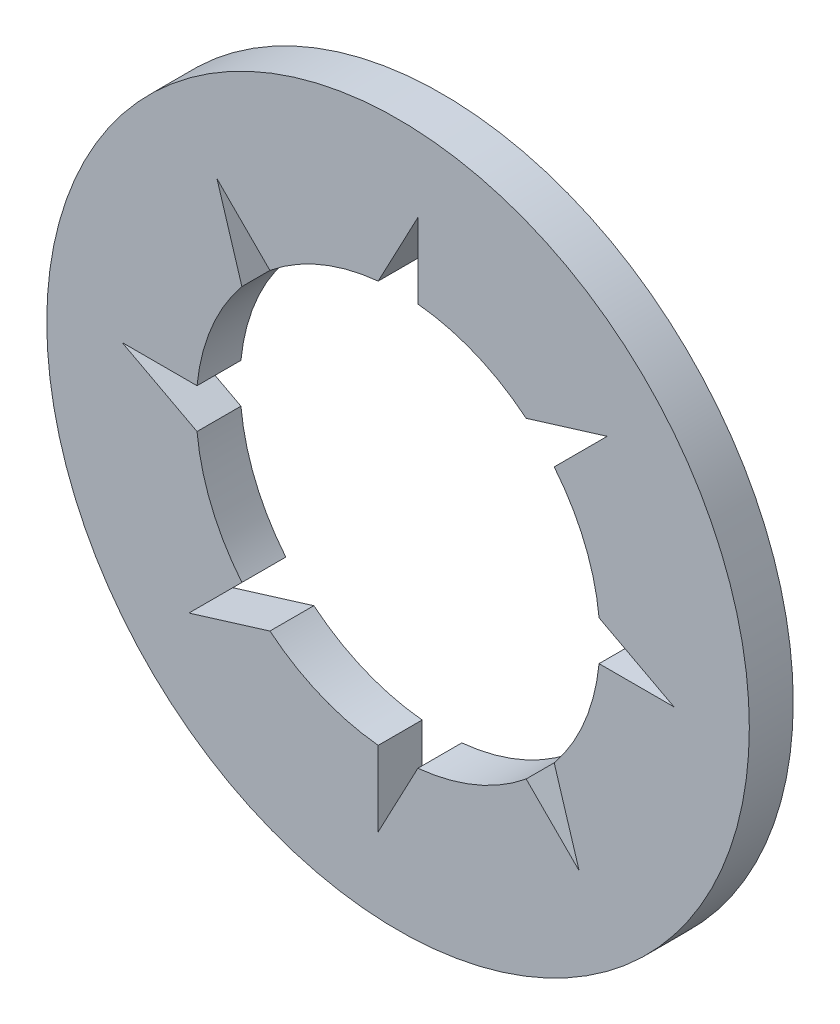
ISO-10303-21;
HEADER;
FILE_DESCRIPTION(('STEP AP214'),'2;1');
FILE_NAME('part.step','',(''),(''),'','','');
FILE_SCHEMA(('AUTOMOTIVE_DESIGN { 1 0 10303 214 1 1 1 1 }'));
ENDSEC;
DATA;
#1=APPLICATION_CONTEXT('core data for automotive mechanical design processes');
#2=APPLICATION_PROTOCOL_DEFINITION('international standard','automotive_design',2000,#1);
#3=PRODUCT_CONTEXT('',#1,'mechanical');
#4=PRODUCT('Part','Part','',(#3));
#5=PRODUCT_RELATED_PRODUCT_CATEGORY('part','',(#4));
#6=PRODUCT_DEFINITION_FORMATION('','',#4);
#7=PRODUCT_DEFINITION_CONTEXT('part definition',#1,'design');
#8=PRODUCT_DEFINITION('design','',#6,#7);
#9=PRODUCT_DEFINITION_SHAPE('','',#8);
#10=(LENGTH_UNIT() NAMED_UNIT(*) SI_UNIT(.MILLI.,.METRE.));
#11=(NAMED_UNIT(*) PLANE_ANGLE_UNIT() SI_UNIT($,.RADIAN.));
#12=(NAMED_UNIT(*) SI_UNIT($,.STERADIAN.) SOLID_ANGLE_UNIT());
#13=UNCERTAINTY_MEASURE_WITH_UNIT(LENGTH_MEASURE(1.E-05),#10,'distance_accuracy_value','');
#14=(GEOMETRIC_REPRESENTATION_CONTEXT(3) GLOBAL_UNCERTAINTY_ASSIGNED_CONTEXT((#13)) GLOBAL_UNIT_ASSIGNED_CONTEXT((#10,
#11,#12)) REPRESENTATION_CONTEXT('',''));
#15=CARTESIAN_POINT('',(0.,0.,0.));
#16=DIRECTION('',(0.,0.,1.));
#17=DIRECTION('',(1.,0.,0.));
#18=AXIS2_PLACEMENT_3D('',#15,#16,#17);
#19=CARTESIAN_POINT('',(0.,0.,-0.5));
#20=DIRECTION('',(0.,0.,1.));
#21=DIRECTION('',(1.,0.,0.));
#22=AXIS2_PLACEMENT_3D('',#19,#20,#21);
#23=CYLINDRICAL_SURFACE('',#22,2.3);
#24=CARTESIAN_POINT('',(0.,0.,-0.5));
#25=DIRECTION('',(0.,0.,1.));
#26=DIRECTION('',(1.,0.,0.));
#27=AXIS2_PLACEMENT_3D('',#24,#25,#26);
#28=CIRCLE('',#27,2.3);
#29=CARTESIAN_POINT('',(1.45882307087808,1.77815501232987,-0.5));
#30=VERTEX_POINT('',#29);
#31=CARTESIAN_POINT('',(0.22580178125,2.28888915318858,-0.5));
#32=VERTEX_POINT('',#31);
#33=EDGE_CURVE('E228',#30,#32,#28,.T.);
#34=ORIENTED_EDGE('',*,*,#33,.F.);
#35=DIRECTION('',(0.,0.,1.));
#36=VECTOR('',#35,1.);
#37=CARTESIAN_POINT('',(1.45882307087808,1.77815501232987,-0.5));
#38=LINE('',#37,#36);
#39=CARTESIAN_POINT('',(1.45882307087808,1.77815501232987,5.6843418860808E-11));
#40=VERTEX_POINT('',#39);
#41=EDGE_CURVE('E367',#30,#40,#38,.T.);
#42=ORIENTED_EDGE('',*,*,#41,.T.);
#43=CARTESIAN_POINT('',(0.,0.,0.));
#44=DIRECTION('',(0.,0.,1.));
#45=DIRECTION('',(1.,0.,0.));
#46=AXIS2_PLACEMENT_3D('',#43,#44,#45);
#47=CIRCLE('',#46,2.3);
#48=CARTESIAN_POINT('',(0.22580178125,2.28888915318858,5.6843418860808E-11));
#49=VERTEX_POINT('',#48);
#50=EDGE_CURVE('E239',#40,#49,#47,.T.);
#51=ORIENTED_EDGE('',*,*,#50,.T.);
#52=DIRECTION('',(0.,0.,1.));
#53=VECTOR('',#52,1.);
#54=CARTESIAN_POINT('',(0.22580178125,2.28888915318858,-0.5));
#55=LINE('',#54,#53);
#56=EDGE_CURVE('E236',#32,#49,#55,.T.);
#57=ORIENTED_EDGE('',*,*,#56,.F.);
#58=EDGE_LOOP('',(#34,#42,#51,#57));
#59=FACE_BOUND('',#58,.T.);
#60=ADVANCED_FACE('F39',(#59),#23,.F.);
#61=CARTESIAN_POINT('',(2.28888915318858,0.225801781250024,5.6843418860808E-11));
#62=VERTEX_POINT('',#61);
#63=CARTESIAN_POINT('',(1.77815501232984,1.45882307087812,0.));
#64=VERTEX_POINT('',#63);
#65=EDGE_CURVE('E220',#62,#64,#47,.T.);
#66=ORIENTED_EDGE('',*,*,#65,.T.);
#67=DIRECTION('',(0.,0.,1.));
#68=VECTOR('',#67,1.);
#69=CARTESIAN_POINT('',(1.77815501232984,1.45882307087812,-0.5));
#70=LINE('',#69,#68);
#71=CARTESIAN_POINT('',(1.77815501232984,1.45882307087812,-0.5));
#72=VERTEX_POINT('',#71);
#73=EDGE_CURVE('E53',#72,#64,#70,.T.);
#74=ORIENTED_EDGE('',*,*,#73,.F.);
#75=CARTESIAN_POINT('',(2.28888915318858,0.225801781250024,-0.5));
#76=VERTEX_POINT('',#75);
#77=EDGE_CURVE('E214',#76,#72,#28,.T.);
#78=ORIENTED_EDGE('',*,*,#77,.F.);
#79=DIRECTION('',(0.,0.,1.));
#80=VECTOR('',#79,1.);
#81=CARTESIAN_POINT('',(2.28888915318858,0.225801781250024,-0.5));
#82=LINE('',#81,#80);
#83=EDGE_CURVE('E352',#76,#62,#82,.T.);
#84=ORIENTED_EDGE('',*,*,#83,.T.);
#85=EDGE_LOOP('',(#66,#74,#78,#84));
#86=FACE_BOUND('',#85,.T.);
#87=ADVANCED_FACE('F212',(#86),#23,.F.);
#88=CARTESIAN_POINT('',(1.77815501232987,-1.45882307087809,5.6843418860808E-11));
#89=VERTEX_POINT('',#88);
#90=CARTESIAN_POINT('',(2.28888915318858,-0.225801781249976,0.));
#91=VERTEX_POINT('',#90);
#92=EDGE_CURVE('E254',#89,#91,#47,.T.);
#93=ORIENTED_EDGE('',*,*,#92,.T.);
#94=DIRECTION('',(0.,0.,1.));
#95=VECTOR('',#94,1.);
#96=CARTESIAN_POINT('',(2.28888915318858,-0.225801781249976,-0.5));
#97=LINE('',#96,#95);
#98=CARTESIAN_POINT('',(2.28888915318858,-0.225801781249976,-0.5));
#99=VERTEX_POINT('',#98);
#100=EDGE_CURVE('E65',#99,#91,#97,.T.);
#101=ORIENTED_EDGE('',*,*,#100,.F.);
#102=CARTESIAN_POINT('',(1.77815501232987,-1.45882307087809,-0.5));
#103=VERTEX_POINT('',#102);
#104=EDGE_CURVE('E222',#103,#99,#28,.T.);
#105=ORIENTED_EDGE('',*,*,#104,.F.);
#106=DIRECTION('',(0.,0.,1.));
#107=VECTOR('',#106,1.);
#108=CARTESIAN_POINT('',(1.77815501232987,-1.45882307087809,-0.5));
#109=LINE('',#108,#107);
#110=EDGE_CURVE('E340',#103,#89,#109,.T.);
#111=ORIENTED_EDGE('',*,*,#110,.T.);
#112=EDGE_LOOP('',(#93,#101,#105,#111));
#113=FACE_BOUND('',#112,.T.);
#114=ADVANCED_FACE('F433',(#113),#23,.F.);
#115=CARTESIAN_POINT('',(0.225801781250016,-2.28888915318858,5.6843418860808E-11));
#116=VERTEX_POINT('',#115);
#117=CARTESIAN_POINT('',(1.45882307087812,-1.77815501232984,0.));
#118=VERTEX_POINT('',#117);
#119=EDGE_CURVE('E417',#116,#118,#47,.T.);
#120=ORIENTED_EDGE('',*,*,#119,.T.);
#121=DIRECTION('',(0.,0.,1.));
#122=VECTOR('',#121,1.);
#123=CARTESIAN_POINT('',(1.45882307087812,-1.77815501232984,-0.5));
#124=LINE('',#123,#122);
#125=CARTESIAN_POINT('',(1.45882307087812,-1.77815501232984,-0.5));
#126=VERTEX_POINT('',#125);
#127=EDGE_CURVE('E345',#126,#118,#124,.T.);
#128=ORIENTED_EDGE('',*,*,#127,.F.);
#129=CARTESIAN_POINT('',(0.225801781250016,-2.28888915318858,-0.5));
#130=VERTEX_POINT('',#129);
#131=EDGE_CURVE('E230',#130,#126,#28,.T.);
#132=ORIENTED_EDGE('',*,*,#131,.F.);
#133=DIRECTION('',(0.,0.,1.));
#134=VECTOR('',#133,1.);
#135=CARTESIAN_POINT('',(0.225801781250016,-2.28888915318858,-0.5));
#136=LINE('',#135,#134);
#137=EDGE_CURVE('E316',#130,#116,#136,.T.);
#138=ORIENTED_EDGE('',*,*,#137,.T.);
#139=EDGE_LOOP('',(#120,#128,#132,#138));
#140=FACE_BOUND('',#139,.T.);
#141=ADVANCED_FACE('F416',(#140),#23,.F.);
#142=CARTESIAN_POINT('',(-1.45882307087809,-1.77815501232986,5.6843418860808E-11));
#143=VERTEX_POINT('',#142);
#144=CARTESIAN_POINT('',(-0.225801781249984,-2.28888915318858,0.));
#145=VERTEX_POINT('',#144);
#146=EDGE_CURVE('E483',#143,#145,#47,.T.);
#147=ORIENTED_EDGE('',*,*,#146,.T.);
#148=DIRECTION('',(0.,0.,1.));
#149=VECTOR('',#148,1.);
#150=CARTESIAN_POINT('',(-0.225801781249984,-2.28888915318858,-0.5));
#151=LINE('',#150,#149);
#152=CARTESIAN_POINT('',(-0.225801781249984,-2.28888915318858,-0.5));
#153=VERTEX_POINT('',#152);
#154=EDGE_CURVE('E323',#153,#145,#151,.T.);
#155=ORIENTED_EDGE('',*,*,#154,.F.);
#156=CARTESIAN_POINT('',(-1.45882307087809,-1.77815501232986,-0.5));
#157=VERTEX_POINT('',#156);
#158=EDGE_CURVE('E407',#157,#153,#28,.T.);
#159=ORIENTED_EDGE('',*,*,#158,.F.);
#160=DIRECTION('',(0.,0.,1.));
#161=VECTOR('',#160,1.);
#162=CARTESIAN_POINT('',(-1.45882307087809,-1.77815501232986,-0.5));
#163=LINE('',#162,#161);
#164=EDGE_CURVE('E301',#157,#143,#163,.T.);
#165=ORIENTED_EDGE('',*,*,#164,.T.);
#166=EDGE_LOOP('',(#147,#155,#159,#165));
#167=FACE_BOUND('',#166,.T.);
#168=ADVANCED_FACE('F468',(#167),#23,.F.);
#169=CARTESIAN_POINT('',(-2.28888915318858,-0.225801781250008,5.6843418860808E-11));
#170=VERTEX_POINT('',#169);
#171=CARTESIAN_POINT('',(-1.77815501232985,-1.45882307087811,0.));
#172=VERTEX_POINT('',#171);
#173=EDGE_CURVE('E246',#170,#172,#47,.T.);
#174=ORIENTED_EDGE('',*,*,#173,.T.);
#175=DIRECTION('',(0.,0.,1.));
#176=VECTOR('',#175,1.);
#177=CARTESIAN_POINT('',(-1.77815501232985,-1.45882307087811,-0.5));
#178=LINE('',#177,#176);
#179=CARTESIAN_POINT('',(-1.77815501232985,-1.45882307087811,-0.5));
#180=VERTEX_POINT('',#179);
#181=EDGE_CURVE('E306',#180,#172,#178,.T.);
#182=ORIENTED_EDGE('',*,*,#181,.F.);
#183=CARTESIAN_POINT('',(-2.28888915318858,-0.225801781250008,-0.5));
#184=VERTEX_POINT('',#183);
#185=EDGE_CURVE('E406',#184,#180,#28,.T.);
#186=ORIENTED_EDGE('',*,*,#185,.F.);
#187=DIRECTION('',(0.,0.,1.));
#188=VECTOR('',#187,1.);
#189=CARTESIAN_POINT('',(-2.28888915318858,-0.225801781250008,-0.5));
#190=LINE('',#189,#188);
#191=EDGE_CURVE('E281',#184,#170,#190,.T.);
#192=ORIENTED_EDGE('',*,*,#191,.T.);
#193=EDGE_LOOP('',(#174,#182,#186,#192));
#194=FACE_BOUND('',#193,.T.);
#195=ADVANCED_FACE('F461',(#194),#23,.F.);
#196=CARTESIAN_POINT('',(-1.77815501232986,1.4588230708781,5.6843418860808E-11));
#197=VERTEX_POINT('',#196);
#198=CARTESIAN_POINT('',(-2.28888915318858,0.225801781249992,0.));
#199=VERTEX_POINT('',#198);
#200=EDGE_CURVE('E237',#197,#199,#47,.T.);
#201=ORIENTED_EDGE('',*,*,#200,.T.);
#202=DIRECTION('',(0.,0.,1.));
#203=VECTOR('',#202,1.);
#204=CARTESIAN_POINT('',(-2.28888915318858,0.225801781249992,-0.5));
#205=LINE('',#204,#203);
#206=CARTESIAN_POINT('',(-2.28888915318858,0.225801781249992,-0.5));
#207=VERTEX_POINT('',#206);
#208=EDGE_CURVE('E286',#207,#199,#205,.T.);
#209=ORIENTED_EDGE('',*,*,#208,.F.);
#210=CARTESIAN_POINT('',(-1.77815501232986,1.4588230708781,-0.5));
#211=VERTEX_POINT('',#210);
#212=EDGE_CURVE('E232',#211,#207,#28,.T.);
#213=ORIENTED_EDGE('',*,*,#212,.F.);
#214=DIRECTION('',(0.,0.,1.));
#215=VECTOR('',#214,1.);
#216=CARTESIAN_POINT('',(-1.77815501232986,1.4588230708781,-0.5));
#217=LINE('',#216,#215);
#218=EDGE_CURVE('E262',#211,#197,#217,.T.);
#219=ORIENTED_EDGE('',*,*,#218,.T.);
#220=EDGE_LOOP('',(#201,#209,#213,#219));
#221=FACE_BOUND('',#220,.T.);
#222=ADVANCED_FACE('F401',(#221),#23,.F.);
#223=CARTESIAN_POINT('',(0.,0.,-0.5));
#224=DIRECTION('',(0.,0.,1.));
#225=DIRECTION('',(1.,0.,0.));
#226=AXIS2_PLACEMENT_3D('',#223,#224,#225);
#227=CYLINDRICAL_SURFACE('',#226,4.);
#228=CARTESIAN_POINT('',(0.,0.,-0.5));
#229=DIRECTION('',(0.,0.,1.));
#230=DIRECTION('',(1.,0.,0.));
#231=AXIS2_PLACEMENT_3D('',#228,#229,#230);
#232=CIRCLE('',#231,4.);
#233=CARTESIAN_POINT('',(4.,0.,-0.5));
#234=VERTEX_POINT('',#233);
#235=EDGE_CURVE('E11',#234,#234,#232,.T.);
#236=ORIENTED_EDGE('',*,*,#235,.T.);
#237=EDGE_LOOP('',(#236));
#238=FACE_BOUND('',#237,.T.);
#239=CARTESIAN_POINT('',(0.,0.,0.));
#240=DIRECTION('',(0.,0.,1.));
#241=DIRECTION('',(1.,0.,0.));
#242=AXIS2_PLACEMENT_3D('',#239,#240,#241);
#243=CIRCLE('',#242,4.);
#244=CARTESIAN_POINT('',(4.,0.,0.));
#245=VERTEX_POINT('',#244);
#246=EDGE_CURVE('E43',#245,#245,#243,.T.);
#247=ORIENTED_EDGE('',*,*,#246,.F.);
#248=EDGE_LOOP('',(#247));
#249=FACE_BOUND('',#248,.T.);
#250=ADVANCED_FACE('F41',(#238,#249),#227,.T.);
#251=CARTESIAN_POINT('',(0.,0.,-0.5));
#252=DIRECTION('',(0.,0.,1.));
#253=DIRECTION('',(1.,0.,0.));
#254=AXIS2_PLACEMENT_3D('',#251,#252,#253);
#255=PLANE('',#254);
#256=DIRECTION('',(0.707106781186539,0.707106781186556,0.));
#257=VECTOR('',#256,1.);
#258=CARTESIAN_POINT('',(1.77815501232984,1.45882307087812,-0.5));
#259=LINE('',#258,#257);
#260=CARTESIAN_POINT('',(2.38132228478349,2.06199034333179,-0.5));
#261=VERTEX_POINT('',#260);
#262=EDGE_CURVE('E199',#72,#261,#259,.T.);
#263=ORIENTED_EDGE('',*,*,#262,.T.);
#264=DIRECTION('',(-0.955782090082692,-0.294075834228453,0.));
#265=VECTOR('',#264,1.);
#266=CARTESIAN_POINT('',(2.38132228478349,2.06199034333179,-0.5));
#267=LINE('',#266,#265);
#268=EDGE_CURVE('E210',#261,#30,#267,.T.);
#269=ORIENTED_EDGE('',*,*,#268,.T.);
#270=ORIENTED_EDGE('',*,*,#33,.T.);
#271=DIRECTION('',(0.,1.,0.));
#272=VECTOR('',#271,1.);
#273=CARTESIAN_POINT('',(0.22580178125,2.28888915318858,-0.5));
#274=LINE('',#273,#272);
#275=CARTESIAN_POINT('',(0.22580178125,3.14189649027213,-0.5));
#276=VERTEX_POINT('',#275);
#277=EDGE_CURVE('E259',#32,#276,#274,.T.);
#278=ORIENTED_EDGE('',*,*,#277,.T.);
#279=DIRECTION('',(-0.467896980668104,-0.883783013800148,0.));
#280=VECTOR('',#279,1.);
#281=CARTESIAN_POINT('',(0.22580178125,3.14189649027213,-0.5));
#282=LINE('',#281,#280);
#283=CARTESIAN_POINT('',(-0.22580178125,2.28888915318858,-0.5));
#284=VERTEX_POINT('',#283);
#285=EDGE_CURVE('E264',#276,#284,#282,.T.);
#286=ORIENTED_EDGE('',*,*,#285,.T.);
#287=CARTESIAN_POINT('',(-1.4588230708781,1.77815501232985,-0.5));
#288=VERTEX_POINT('',#287);
#289=EDGE_CURVE('E233',#284,#288,#28,.T.);
#290=ORIENTED_EDGE('',*,*,#289,.T.);
#291=DIRECTION('',(-0.707106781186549,0.707106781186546,0.));
#292=VECTOR('',#291,1.);
#293=CARTESIAN_POINT('',(-1.4588230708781,1.77815501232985,-0.5));
#294=LINE('',#293,#292);
#295=CARTESIAN_POINT('',(-2.06199034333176,2.38132228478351,-0.5));
#296=VERTEX_POINT('',#295);
#297=EDGE_CURVE('E278',#288,#296,#294,.T.);
#298=ORIENTED_EDGE('',*,*,#297,.T.);
#299=DIRECTION('',(0.294075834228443,-0.955782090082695,0.));
#300=VECTOR('',#299,1.);
#301=CARTESIAN_POINT('',(-2.06199034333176,2.38132228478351,-0.5));
#302=LINE('',#301,#300);
#303=EDGE_CURVE('E271',#296,#211,#302,.T.);
#304=ORIENTED_EDGE('',*,*,#303,.T.);
#305=ORIENTED_EDGE('',*,*,#212,.T.);
#306=DIRECTION('',(-1.,0.,0.));
#307=VECTOR('',#306,1.);
#308=CARTESIAN_POINT('',(-2.28888915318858,0.225801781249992,-0.5));
#309=LINE('',#308,#307);
#310=CARTESIAN_POINT('',(-3.14189649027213,0.225801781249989,-0.5));
#311=VERTEX_POINT('',#310);
#312=EDGE_CURVE('E300',#207,#311,#309,.T.);
#313=ORIENTED_EDGE('',*,*,#312,.T.);
#314=DIRECTION('',(0.88378301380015,-0.467896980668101,0.));
#315=VECTOR('',#314,1.);
#316=CARTESIAN_POINT('',(-3.14189649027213,0.225801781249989,-0.5));
#317=LINE('',#316,#315);
#318=EDGE_CURVE('E293',#311,#184,#317,.T.);
#319=ORIENTED_EDGE('',*,*,#318,.T.);
#320=ORIENTED_EDGE('',*,*,#185,.T.);
#321=DIRECTION('',(-0.707106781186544,-0.707106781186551,0.));
#322=VECTOR('',#321,1.);
#323=CARTESIAN_POINT('',(-1.77815501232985,-1.45882307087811,-0.5));
#324=LINE('',#323,#322);
#325=CARTESIAN_POINT('',(-2.3813222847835,-2.06199034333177,-0.5));
#326=VERTEX_POINT('',#325);
#327=EDGE_CURVE('E314',#180,#326,#324,.T.);
#328=ORIENTED_EDGE('',*,*,#327,.T.);
#329=DIRECTION('',(0.955782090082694,0.294075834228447,0.));
#330=VECTOR('',#329,1.);
#331=CARTESIAN_POINT('',(-2.3813222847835,-2.06199034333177,-0.5));
#332=LINE('',#331,#330);
#333=EDGE_CURVE('E307',#326,#157,#332,.T.);
#334=ORIENTED_EDGE('',*,*,#333,.T.);
#335=ORIENTED_EDGE('',*,*,#158,.T.);
#336=DIRECTION('',(0.,-1.,0.));
#337=VECTOR('',#336,1.);
#338=CARTESIAN_POINT('',(-0.225801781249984,-2.28888915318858,-0.5));
#339=LINE('',#338,#337);
#340=CARTESIAN_POINT('',(-0.225801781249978,-3.14189649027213,-0.5));
#341=VERTEX_POINT('',#340);
#342=EDGE_CURVE('E331',#153,#341,#339,.T.);
#343=ORIENTED_EDGE('',*,*,#342,.T.);
#344=DIRECTION('',(0.467896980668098,0.883783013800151,0.));
#345=VECTOR('',#344,1.);
#346=CARTESIAN_POINT('',(-0.225801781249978,-3.14189649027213,-0.5));
#347=LINE('',#346,#345);
#348=EDGE_CURVE('E330',#341,#130,#347,.T.);
#349=ORIENTED_EDGE('',*,*,#348,.T.);
#350=ORIENTED_EDGE('',*,*,#131,.T.);
#351=DIRECTION('',(0.707106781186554,-0.707106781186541,0.));
#352=VECTOR('',#351,1.);
#353=CARTESIAN_POINT('',(1.45882307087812,-1.77815501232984,-0.5));
#354=LINE('',#353,#352);
#355=CARTESIAN_POINT('',(2.06199034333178,-2.38132228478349,-0.5));
#356=VERTEX_POINT('',#355);
#357=EDGE_CURVE('E353',#126,#356,#354,.T.);
#358=ORIENTED_EDGE('',*,*,#357,.T.);
#359=DIRECTION('',(-0.29407583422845,0.955782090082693,0.));
#360=VECTOR('',#359,1.);
#361=CARTESIAN_POINT('',(2.06199034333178,-2.38132228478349,-0.5));
#362=LINE('',#361,#360);
#363=EDGE_CURVE('E344',#356,#103,#362,.T.);
#364=ORIENTED_EDGE('',*,*,#363,.T.);
#365=ORIENTED_EDGE('',*,*,#104,.T.);
#366=DIRECTION('',(1.,0.,0.));
#367=VECTOR('',#366,1.);
#368=CARTESIAN_POINT('',(2.28888915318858,-0.225801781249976,-0.5));
#369=LINE('',#368,#367);
#370=CARTESIAN_POINT('',(3.14189649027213,-0.225801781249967,-0.5));
#371=VERTEX_POINT('',#370);
#372=EDGE_CURVE('E366',#99,#371,#369,.T.);
#373=ORIENTED_EDGE('',*,*,#372,.T.);
#374=DIRECTION('',(-0.883783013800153,0.467896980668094,0.));
#375=VECTOR('',#374,1.);
#376=CARTESIAN_POINT('',(3.14189649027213,-0.225801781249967,-0.5));
#377=LINE('',#376,#375);
#378=EDGE_CURVE('E224',#371,#76,#377,.T.);
#379=ORIENTED_EDGE('',*,*,#378,.T.);
#380=ORIENTED_EDGE('',*,*,#77,.T.);
#381=EDGE_LOOP('',(#263,#269,#270,#278,#286,#290,#298,#304,#305,#313,#319,#320,#328,#334,#335,
#343,#349,#350,#358,#364,#365,#373,#379,#380));
#382=FACE_BOUND('',#381,.T.);
#383=ORIENTED_EDGE('',*,*,#235,.F.);
#384=EDGE_LOOP('',(#383));
#385=FACE_BOUND('',#384,.T.);
#386=ADVANCED_FACE('F219',(#382,#385),#255,.F.);
#387=CARTESIAN_POINT('',(0.,0.,0.));
#388=DIRECTION('',(0.,0.,1.));
#389=DIRECTION('',(1.,0.,0.));
#390=AXIS2_PLACEMENT_3D('',#387,#388,#389);
#391=PLANE('',#390);
#392=DIRECTION('',(-0.955782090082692,-0.294075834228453,0.));
#393=VECTOR('',#392,1.);
#394=CARTESIAN_POINT('',(2.38132228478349,2.06199034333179,5.6843418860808E-11));
#395=LINE('',#394,#393);
#396=CARTESIAN_POINT('',(2.38132228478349,2.06199034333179,5.6843418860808E-11));
#397=VERTEX_POINT('',#396);
#398=EDGE_CURVE('E206',#397,#40,#395,.T.);
#399=ORIENTED_EDGE('',*,*,#398,.F.);
#400=DIRECTION('',(0.707106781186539,0.707106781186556,0.));
#401=VECTOR('',#400,1.);
#402=CARTESIAN_POINT('',(1.77815501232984,1.45882307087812,5.6843418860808E-11));
#403=LINE('',#402,#401);
#404=EDGE_CURVE('E374',#64,#397,#403,.T.);
#405=ORIENTED_EDGE('',*,*,#404,.F.);
#406=ORIENTED_EDGE('',*,*,#65,.F.);
#407=DIRECTION('',(-0.883783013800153,0.467896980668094,0.));
#408=VECTOR('',#407,1.);
#409=CARTESIAN_POINT('',(3.14189649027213,-0.225801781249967,5.6843418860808E-11));
#410=LINE('',#409,#408);
#411=CARTESIAN_POINT('',(3.14189649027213,-0.225801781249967,5.6843418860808E-11));
#412=VERTEX_POINT('',#411);
#413=EDGE_CURVE('E364',#412,#62,#410,.T.);
#414=ORIENTED_EDGE('',*,*,#413,.F.);
#415=DIRECTION('',(1.,0.,0.));
#416=VECTOR('',#415,1.);
#417=CARTESIAN_POINT('',(2.28888915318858,-0.225801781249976,5.6843418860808E-11));
#418=LINE('',#417,#416);
#419=EDGE_CURVE('E370',#91,#412,#418,.T.);
#420=ORIENTED_EDGE('',*,*,#419,.F.);
#421=ORIENTED_EDGE('',*,*,#92,.F.);
#422=DIRECTION('',(-0.29407583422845,0.955782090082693,0.));
#423=VECTOR('',#422,1.);
#424=CARTESIAN_POINT('',(2.06199034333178,-2.38132228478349,5.6843418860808E-11));
#425=LINE('',#424,#423);
#426=CARTESIAN_POINT('',(2.06199034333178,-2.38132228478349,5.6843418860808E-11));
#427=VERTEX_POINT('',#426);
#428=EDGE_CURVE('E347',#427,#89,#425,.T.);
#429=ORIENTED_EDGE('',*,*,#428,.F.);
#430=DIRECTION('',(0.707106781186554,-0.707106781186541,0.));
#431=VECTOR('',#430,1.);
#432=CARTESIAN_POINT('',(1.45882307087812,-1.77815501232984,5.6843418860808E-11));
#433=LINE('',#432,#431);
#434=EDGE_CURVE('E355',#118,#427,#433,.T.);
#435=ORIENTED_EDGE('',*,*,#434,.F.);
#436=ORIENTED_EDGE('',*,*,#119,.F.);
#437=DIRECTION('',(0.467896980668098,0.883783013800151,0.));
#438=VECTOR('',#437,1.);
#439=CARTESIAN_POINT('',(-0.225801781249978,-3.14189649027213,5.6843418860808E-11));
#440=LINE('',#439,#438);
#441=CARTESIAN_POINT('',(-0.225801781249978,-3.14189649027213,5.6843418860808E-11));
#442=VERTEX_POINT('',#441);
#443=EDGE_CURVE('E333',#442,#116,#440,.T.);
#444=ORIENTED_EDGE('',*,*,#443,.F.);
#445=DIRECTION('',(0.,-1.,0.));
#446=VECTOR('',#445,1.);
#447=CARTESIAN_POINT('',(-0.225801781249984,-2.28888915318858,5.6843418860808E-11));
#448=LINE('',#447,#446);
#449=EDGE_CURVE('E334',#145,#442,#448,.T.);
#450=ORIENTED_EDGE('',*,*,#449,.F.);
#451=ORIENTED_EDGE('',*,*,#146,.F.);
#452=DIRECTION('',(0.955782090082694,0.294075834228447,0.));
#453=VECTOR('',#452,1.);
#454=CARTESIAN_POINT('',(-2.3813222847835,-2.06199034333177,5.6843418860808E-11));
#455=LINE('',#454,#453);
#456=CARTESIAN_POINT('',(-2.3813222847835,-2.06199034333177,5.6843418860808E-11));
#457=VERTEX_POINT('',#456);
#458=EDGE_CURVE('E312',#457,#143,#455,.T.);
#459=ORIENTED_EDGE('',*,*,#458,.F.);
#460=DIRECTION('',(-0.707106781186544,-0.707106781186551,0.));
#461=VECTOR('',#460,1.);
#462=CARTESIAN_POINT('',(-1.77815501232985,-1.45882307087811,5.6843418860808E-11));
#463=LINE('',#462,#461);
#464=EDGE_CURVE('E317',#172,#457,#463,.T.);
#465=ORIENTED_EDGE('',*,*,#464,.F.);
#466=ORIENTED_EDGE('',*,*,#173,.F.);
#467=DIRECTION('',(0.88378301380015,-0.467896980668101,0.));
#468=VECTOR('',#467,1.);
#469=CARTESIAN_POINT('',(-3.14189649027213,0.225801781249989,5.6843418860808E-11));
#470=LINE('',#469,#468);
#471=CARTESIAN_POINT('',(-3.14189649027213,0.225801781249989,5.6843418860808E-11));
#472=VERTEX_POINT('',#471);
#473=EDGE_CURVE('E294',#472,#170,#470,.T.);
#474=ORIENTED_EDGE('',*,*,#473,.F.);
#475=DIRECTION('',(-1.,0.,0.));
#476=VECTOR('',#475,1.);
#477=CARTESIAN_POINT('',(-2.28888915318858,0.225801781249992,5.6843418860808E-11));
#478=LINE('',#477,#476);
#479=EDGE_CURVE('E296',#199,#472,#478,.T.);
#480=ORIENTED_EDGE('',*,*,#479,.F.);
#481=ORIENTED_EDGE('',*,*,#200,.F.);
#482=DIRECTION('',(0.294075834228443,-0.955782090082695,0.));
#483=VECTOR('',#482,1.);
#484=CARTESIAN_POINT('',(-2.06199034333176,2.38132228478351,5.6843418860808E-11));
#485=LINE('',#484,#483);
#486=CARTESIAN_POINT('',(-2.06199034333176,2.38132228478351,5.6843418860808E-11));
#487=VERTEX_POINT('',#486);
#488=EDGE_CURVE('E280',#487,#197,#485,.T.);
#489=ORIENTED_EDGE('',*,*,#488,.F.);
#490=DIRECTION('',(-0.707106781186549,0.707106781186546,0.));
#491=VECTOR('',#490,1.);
#492=CARTESIAN_POINT('',(-1.4588230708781,1.77815501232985,5.6843418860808E-11));
#493=LINE('',#492,#491);
#494=CARTESIAN_POINT('',(-1.4588230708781,1.77815501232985,5.6843418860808E-11));
#495=VERTEX_POINT('',#494);
#496=EDGE_CURVE('E279',#495,#487,#493,.T.);
#497=ORIENTED_EDGE('',*,*,#496,.F.);
#498=CARTESIAN_POINT('',(-0.22580178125,2.28888915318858,5.6843418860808E-11));
#499=VERTEX_POINT('',#498);
#500=EDGE_CURVE('E229',#499,#495,#47,.T.);
#501=ORIENTED_EDGE('',*,*,#500,.F.);
#502=DIRECTION('',(-0.467896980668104,-0.883783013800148,0.));
#503=VECTOR('',#502,1.);
#504=CARTESIAN_POINT('',(0.22580178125,3.14189649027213,5.6843418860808E-11));
#505=LINE('',#504,#503);
#506=CARTESIAN_POINT('',(0.22580178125,3.14189649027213,5.6843418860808E-11));
#507=VERTEX_POINT('',#506);
#508=EDGE_CURVE('E257',#507,#499,#505,.T.);
#509=ORIENTED_EDGE('',*,*,#508,.F.);
#510=DIRECTION('',(0.,1.,0.));
#511=VECTOR('',#510,1.);
#512=CARTESIAN_POINT('',(0.22580178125,2.28888915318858,5.6843418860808E-11));
#513=LINE('',#512,#511);
#514=EDGE_CURVE('E263',#49,#507,#513,.T.);
#515=ORIENTED_EDGE('',*,*,#514,.F.);
#516=ORIENTED_EDGE('',*,*,#50,.F.);
#517=EDGE_LOOP('',(#399,#405,#406,#414,#420,#421,#429,#435,#436,#444,#450,#451,#459,#465,#466,
#474,#480,#481,#489,#497,#501,#509,#515,#516));
#518=FACE_BOUND('',#517,.T.);
#519=ORIENTED_EDGE('',*,*,#246,.T.);
#520=EDGE_LOOP('',(#519));
#521=FACE_BOUND('',#520,.T.);
#522=ADVANCED_FACE('F386',(#518,#521),#391,.T.);
#523=ORIENTED_EDGE('',*,*,#500,.T.);
#524=DIRECTION('',(0.,0.,1.));
#525=VECTOR('',#524,1.);
#526=CARTESIAN_POINT('',(-1.4588230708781,1.77815501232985,-0.5));
#527=LINE('',#526,#525);
#528=EDGE_CURVE('E267',#288,#495,#527,.T.);
#529=ORIENTED_EDGE('',*,*,#528,.F.);
#530=ORIENTED_EDGE('',*,*,#289,.F.);
#531=DIRECTION('',(0.,0.,1.));
#532=VECTOR('',#531,1.);
#533=CARTESIAN_POINT('',(-0.22580178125,2.28888915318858,-0.5));
#534=LINE('',#533,#532);
#535=EDGE_CURVE('E250',#284,#499,#534,.T.);
#536=ORIENTED_EDGE('',*,*,#535,.T.);
#537=EDGE_LOOP('',(#523,#529,#530,#536));
#538=FACE_BOUND('',#537,.T.);
#539=ADVANCED_FACE('F395',(#538),#23,.F.);
#540=CARTESIAN_POINT('',(0.22580178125,3.14189649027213,-0.5));
#541=DIRECTION('',(-0.883783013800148,0.467896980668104,0.));
#542=DIRECTION('',(-0.467896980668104,-0.883783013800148,0.));
#543=AXIS2_PLACEMENT_3D('',#540,#541,#542);
#544=PLANE('',#543);
#545=ORIENTED_EDGE('',*,*,#508,.T.);
#546=ORIENTED_EDGE('',*,*,#535,.F.);
#547=ORIENTED_EDGE('',*,*,#285,.F.);
#548=DIRECTION('',(0.,0.,1.));
#549=VECTOR('',#548,1.);
#550=CARTESIAN_POINT('',(0.22580178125,3.14189649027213,-0.5));
#551=LINE('',#550,#549);
#552=EDGE_CURVE('E251',#276,#507,#551,.T.);
#553=ORIENTED_EDGE('',*,*,#552,.T.);
#554=EDGE_LOOP('',(#545,#546,#547,#553));
#555=FACE_BOUND('',#554,.T.);
#556=ADVANCED_FACE('F389',(#555),#544,.F.);
#557=CARTESIAN_POINT('',(0.22580178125,2.28888915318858,-0.5));
#558=DIRECTION('',(1.,0.,0.));
#559=DIRECTION('',(0.,0.,-1.));
#560=AXIS2_PLACEMENT_3D('',#557,#558,#559);
#561=PLANE('',#560);
#562=ORIENTED_EDGE('',*,*,#514,.T.);
#563=ORIENTED_EDGE('',*,*,#552,.F.);
#564=ORIENTED_EDGE('',*,*,#277,.F.);
#565=ORIENTED_EDGE('',*,*,#56,.T.);
#566=EDGE_LOOP('',(#562,#563,#564,#565));
#567=FACE_BOUND('',#566,.T.);
#568=ADVANCED_FACE('F385',(#567),#561,.F.);
#569=CARTESIAN_POINT('',(-2.06199034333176,2.38132228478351,-0.5));
#570=DIRECTION('',(-0.955782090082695,-0.294075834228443,0.));
#571=DIRECTION('',(0.294075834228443,-0.955782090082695,0.));
#572=AXIS2_PLACEMENT_3D('',#569,#570,#571);
#573=PLANE('',#572);
#574=ORIENTED_EDGE('',*,*,#488,.T.);
#575=ORIENTED_EDGE('',*,*,#218,.F.);
#576=ORIENTED_EDGE('',*,*,#303,.F.);
#577=DIRECTION('',(0.,0.,1.));
#578=VECTOR('',#577,1.);
#579=CARTESIAN_POINT('',(-2.06199034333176,2.38132228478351,-0.5));
#580=LINE('',#579,#578);
#581=EDGE_CURVE('E275',#296,#487,#580,.T.);
#582=ORIENTED_EDGE('',*,*,#581,.T.);
#583=EDGE_LOOP('',(#574,#575,#576,#582));
#584=FACE_BOUND('',#583,.T.);
#585=ADVANCED_FACE('F399',(#584),#573,.F.);
#586=CARTESIAN_POINT('',(-1.4588230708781,1.77815501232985,-0.5));
#587=DIRECTION('',(0.707106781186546,0.707106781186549,0.));
#588=DIRECTION('',(-0.707106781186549,0.707106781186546,0.));
#589=AXIS2_PLACEMENT_3D('',#586,#587,#588);
#590=PLANE('',#589);
#591=ORIENTED_EDGE('',*,*,#496,.T.);
#592=ORIENTED_EDGE('',*,*,#581,.F.);
#593=ORIENTED_EDGE('',*,*,#297,.F.);
#594=ORIENTED_EDGE('',*,*,#528,.T.);
#595=EDGE_LOOP('',(#591,#592,#593,#594));
#596=FACE_BOUND('',#595,.T.);
#597=ADVANCED_FACE('F392',(#596),#590,.F.);
#598=CARTESIAN_POINT('',(-3.14189649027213,0.225801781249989,-0.5));
#599=DIRECTION('',(-0.467896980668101,-0.883783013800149,0.));
#600=DIRECTION('',(0.883783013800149,-0.467896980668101,0.));
#601=AXIS2_PLACEMENT_3D('',#598,#599,#600);
#602=PLANE('',#601);
#603=ORIENTED_EDGE('',*,*,#473,.T.);
#604=ORIENTED_EDGE('',*,*,#191,.F.);
#605=ORIENTED_EDGE('',*,*,#318,.F.);
#606=DIRECTION('',(0.,0.,1.));
#607=VECTOR('',#606,1.);
#608=CARTESIAN_POINT('',(-3.14189649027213,0.225801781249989,-0.5));
#609=LINE('',#608,#607);
#610=EDGE_CURVE('E287',#311,#472,#609,.T.);
#611=ORIENTED_EDGE('',*,*,#610,.T.);
#612=EDGE_LOOP('',(#603,#604,#605,#611));
#613=FACE_BOUND('',#612,.T.);
#614=ADVANCED_FACE('F508',(#613),#602,.F.);
#615=CARTESIAN_POINT('',(-2.28888915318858,0.225801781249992,-0.5));
#616=DIRECTION('',(0.,1.,0.));
#617=DIRECTION('',(-1.,0.,0.));
#618=AXIS2_PLACEMENT_3D('',#615,#616,#617);
#619=PLANE('',#618);
#620=ORIENTED_EDGE('',*,*,#479,.T.);
#621=ORIENTED_EDGE('',*,*,#610,.F.);
#622=ORIENTED_EDGE('',*,*,#312,.F.);
#623=ORIENTED_EDGE('',*,*,#208,.T.);
#624=EDGE_LOOP('',(#620,#621,#622,#623));
#625=FACE_BOUND('',#624,.T.);
#626=ADVANCED_FACE('F506',(#625),#619,.F.);
#627=CARTESIAN_POINT('',(-2.3813222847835,-2.06199034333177,-0.5));
#628=DIRECTION('',(0.294075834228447,-0.955782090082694,0.));
#629=DIRECTION('',(0.955782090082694,0.294075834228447,0.));
#630=AXIS2_PLACEMENT_3D('',#627,#628,#629);
#631=PLANE('',#630);
#632=ORIENTED_EDGE('',*,*,#458,.T.);
#633=ORIENTED_EDGE('',*,*,#164,.F.);
#634=ORIENTED_EDGE('',*,*,#333,.F.);
#635=DIRECTION('',(0.,0.,1.));
#636=VECTOR('',#635,1.);
#637=CARTESIAN_POINT('',(-2.3813222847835,-2.06199034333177,-0.5));
#638=LINE('',#637,#636);
#639=EDGE_CURVE('E308',#326,#457,#638,.T.);
#640=ORIENTED_EDGE('',*,*,#639,.T.);
#641=EDGE_LOOP('',(#632,#633,#634,#640));
#642=FACE_BOUND('',#641,.T.);
#643=ADVANCED_FACE('F497',(#642),#631,.F.);
#644=CARTESIAN_POINT('',(-1.77815501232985,-1.45882307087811,-0.5));
#645=DIRECTION('',(-0.707106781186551,0.707106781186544,0.));
#646=DIRECTION('',(-0.707106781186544,-0.707106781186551,0.));
#647=AXIS2_PLACEMENT_3D('',#644,#645,#646);
#648=PLANE('',#647);
#649=ORIENTED_EDGE('',*,*,#464,.T.);
#650=ORIENTED_EDGE('',*,*,#639,.F.);
#651=ORIENTED_EDGE('',*,*,#327,.F.);
#652=ORIENTED_EDGE('',*,*,#181,.T.);
#653=EDGE_LOOP('',(#649,#650,#651,#652));
#654=FACE_BOUND('',#653,.T.);
#655=ADVANCED_FACE('F495',(#654),#648,.F.);
#656=CARTESIAN_POINT('',(-0.225801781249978,-3.14189649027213,-0.5));
#657=DIRECTION('',(0.883783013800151,-0.467896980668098,0.));
#658=DIRECTION('',(0.467896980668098,0.883783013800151,0.));
#659=AXIS2_PLACEMENT_3D('',#656,#657,#658);
#660=PLANE('',#659);
#661=ORIENTED_EDGE('',*,*,#443,.T.);
#662=ORIENTED_EDGE('',*,*,#137,.F.);
#663=ORIENTED_EDGE('',*,*,#348,.F.);
#664=DIRECTION('',(0.,0.,1.));
#665=VECTOR('',#664,1.);
#666=CARTESIAN_POINT('',(-0.225801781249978,-3.14189649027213,-0.5));
#667=LINE('',#666,#665);
#668=EDGE_CURVE('E328',#341,#442,#667,.T.);
#669=ORIENTED_EDGE('',*,*,#668,.T.);
#670=EDGE_LOOP('',(#661,#662,#663,#669));
#671=FACE_BOUND('',#670,.T.);
#672=ADVANCED_FACE('F489',(#671),#660,.F.);
#673=CARTESIAN_POINT('',(-0.225801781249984,-2.28888915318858,-0.5));
#674=DIRECTION('',(-1.,0.,0.));
#675=DIRECTION('',(0.,-1.,0.));
#676=AXIS2_PLACEMENT_3D('',#673,#674,#675);
#677=PLANE('',#676);
#678=ORIENTED_EDGE('',*,*,#449,.T.);
#679=ORIENTED_EDGE('',*,*,#668,.F.);
#680=ORIENTED_EDGE('',*,*,#342,.F.);
#681=ORIENTED_EDGE('',*,*,#154,.T.);
#682=EDGE_LOOP('',(#678,#679,#680,#681));
#683=FACE_BOUND('',#682,.T.);
#684=ADVANCED_FACE('F486',(#683),#677,.F.);
#685=CARTESIAN_POINT('',(2.06199034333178,-2.38132228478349,-0.5));
#686=DIRECTION('',(0.955782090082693,0.29407583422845,0.));
#687=DIRECTION('',(-0.29407583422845,0.955782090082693,0.));
#688=AXIS2_PLACEMENT_3D('',#685,#686,#687);
#689=PLANE('',#688);
#690=ORIENTED_EDGE('',*,*,#428,.T.);
#691=ORIENTED_EDGE('',*,*,#110,.F.);
#692=ORIENTED_EDGE('',*,*,#363,.F.);
#693=DIRECTION('',(0.,0.,1.));
#694=VECTOR('',#693,1.);
#695=CARTESIAN_POINT('',(2.06199034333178,-2.38132228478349,-0.5));
#696=LINE('',#695,#694);
#697=EDGE_CURVE('E343',#356,#427,#696,.T.);
#698=ORIENTED_EDGE('',*,*,#697,.T.);
#699=EDGE_LOOP('',(#690,#691,#692,#698));
#700=FACE_BOUND('',#699,.T.);
#701=ADVANCED_FACE('F429',(#700),#689,.F.);
#702=CARTESIAN_POINT('',(1.45882307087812,-1.77815501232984,-0.5));
#703=DIRECTION('',(-0.707106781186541,-0.707106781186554,0.));
#704=DIRECTION('',(0.707106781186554,-0.707106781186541,0.));
#705=AXIS2_PLACEMENT_3D('',#702,#703,#704);
#706=PLANE('',#705);
#707=ORIENTED_EDGE('',*,*,#434,.T.);
#708=ORIENTED_EDGE('',*,*,#697,.F.);
#709=ORIENTED_EDGE('',*,*,#357,.F.);
#710=ORIENTED_EDGE('',*,*,#127,.T.);
#711=EDGE_LOOP('',(#707,#708,#709,#710));
#712=FACE_BOUND('',#711,.T.);
#713=ADVANCED_FACE('F421',(#712),#706,.F.);
#714=CARTESIAN_POINT('',(3.14189649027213,-0.225801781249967,-0.5));
#715=DIRECTION('',(0.467896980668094,0.883783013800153,0.));
#716=DIRECTION('',(-0.883783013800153,0.467896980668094,0.));
#717=AXIS2_PLACEMENT_3D('',#714,#715,#716);
#718=PLANE('',#717);
#719=ORIENTED_EDGE('',*,*,#413,.T.);
#720=ORIENTED_EDGE('',*,*,#83,.F.);
#721=ORIENTED_EDGE('',*,*,#378,.F.);
#722=DIRECTION('',(0.,0.,1.));
#723=VECTOR('',#722,1.);
#724=CARTESIAN_POINT('',(3.14189649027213,-0.225801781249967,-0.5));
#725=LINE('',#724,#723);
#726=EDGE_CURVE('E363',#371,#412,#725,.T.);
#727=ORIENTED_EDGE('',*,*,#726,.T.);
#728=EDGE_LOOP('',(#719,#720,#721,#727));
#729=FACE_BOUND('',#728,.T.);
#730=ADVANCED_FACE('F440',(#729),#718,.F.);
#731=CARTESIAN_POINT('',(2.28888915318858,-0.225801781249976,-0.5));
#732=DIRECTION('',(0.,-1.,0.));
#733=DIRECTION('',(1.,0.,0.));
#734=AXIS2_PLACEMENT_3D('',#731,#732,#733);
#735=PLANE('',#734);
#736=ORIENTED_EDGE('',*,*,#419,.T.);
#737=ORIENTED_EDGE('',*,*,#726,.F.);
#738=ORIENTED_EDGE('',*,*,#372,.F.);
#739=ORIENTED_EDGE('',*,*,#100,.T.);
#740=EDGE_LOOP('',(#736,#737,#738,#739));
#741=FACE_BOUND('',#740,.T.);
#742=ADVANCED_FACE('F432',(#741),#735,.F.);
#743=CARTESIAN_POINT('',(2.38132228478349,2.06199034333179,-0.5));
#744=DIRECTION('',(-0.294075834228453,0.955782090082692,0.));
#745=DIRECTION('',(-0.955782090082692,-0.294075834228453,0.));
#746=AXIS2_PLACEMENT_3D('',#743,#744,#745);
#747=PLANE('',#746);
#748=ORIENTED_EDGE('',*,*,#398,.T.);
#749=ORIENTED_EDGE('',*,*,#41,.F.);
#750=ORIENTED_EDGE('',*,*,#268,.F.);
#751=DIRECTION('',(0.,0.,1.));
#752=VECTOR('',#751,1.);
#753=CARTESIAN_POINT('',(2.38132228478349,2.06199034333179,-0.5));
#754=LINE('',#753,#752);
#755=EDGE_CURVE('E205',#261,#397,#754,.T.);
#756=ORIENTED_EDGE('',*,*,#755,.T.);
#757=EDGE_LOOP('',(#748,#749,#750,#756));
#758=FACE_BOUND('',#757,.T.);
#759=ADVANCED_FACE('F438',(#758),#747,.F.);
#760=CARTESIAN_POINT('',(1.77815501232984,1.45882307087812,-0.5));
#761=DIRECTION('',(0.707106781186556,-0.707106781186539,0.));
#762=DIRECTION('',(0.707106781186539,0.707106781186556,0.));
#763=AXIS2_PLACEMENT_3D('',#760,#761,#762);
#764=PLANE('',#763);
#765=ORIENTED_EDGE('',*,*,#404,.T.);
#766=ORIENTED_EDGE('',*,*,#755,.F.);
#767=ORIENTED_EDGE('',*,*,#262,.F.);
#768=ORIENTED_EDGE('',*,*,#73,.T.);
#769=EDGE_LOOP('',(#765,#766,#767,#768));
#770=FACE_BOUND('',#769,.T.);
#771=ADVANCED_FACE('F203',(#770),#764,.F.);
#772=CLOSED_SHELL('',(#60,#87,#114,#141,#168,#195,#222,#250,#386,#522,#539,#556,#568,#585,#597,
#614,#626,#643,#655,#672,#684,#701,#713,#730,#742,#759,#771));
#773=MANIFOLD_SOLID_BREP('B2',#772);
#774=ADVANCED_BREP_SHAPE_REPRESENTATION('',(#18,#773),#14);
#775=SHAPE_DEFINITION_REPRESENTATION(#9,#774);
ENDSEC;
END-ISO-10303-21;
